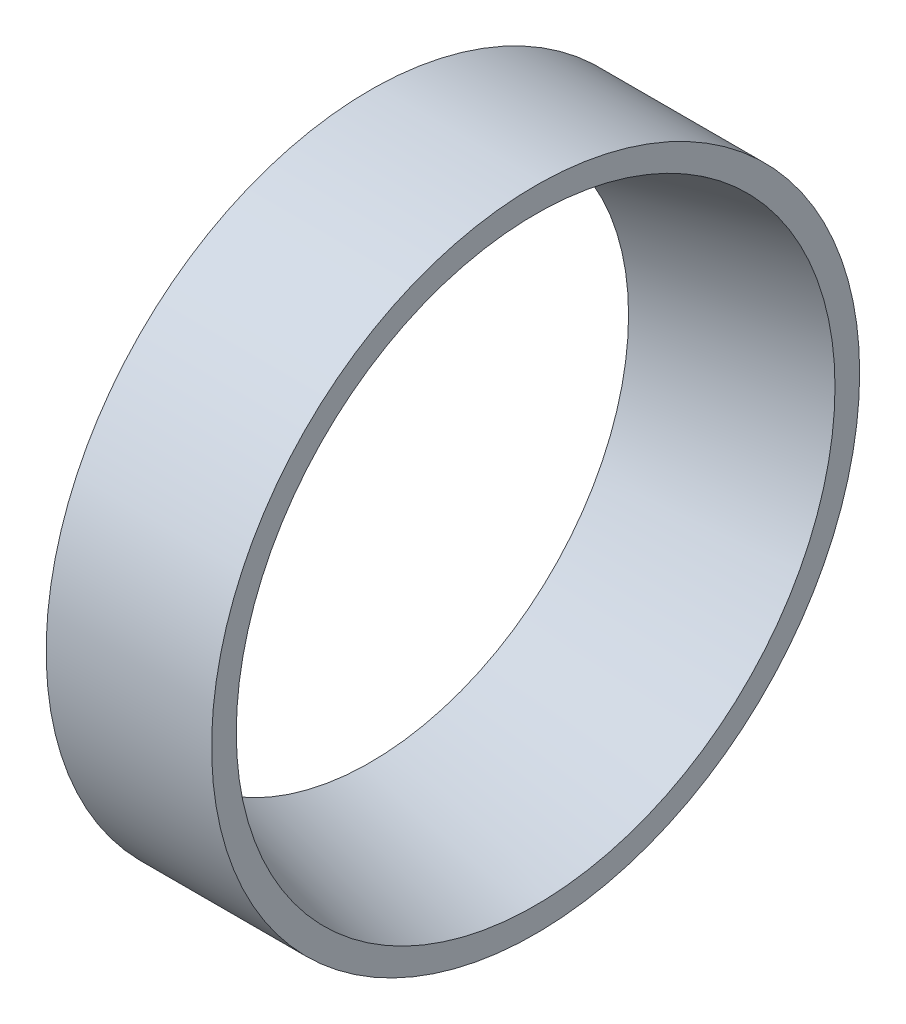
from build123d import *


with BuildPart() as part:
    # Esquisse1 → Base-R_volution (revolve)
    with BuildSketch(Plane.XY, mode=Mode.PRIVATE) as base_r_volution_sk:
        Polygon((0, 21.712), (0, 23.5), (-12, 23.5), (-12, 18.74), align=None)
    revolve(base_r_volution_sk.sketch.rotate(Axis((40, 0, 0), (-1, 0, 0)), 90), axis=Axis((40, 0, 0), (-1, 0, 0)))


solid = part.part
